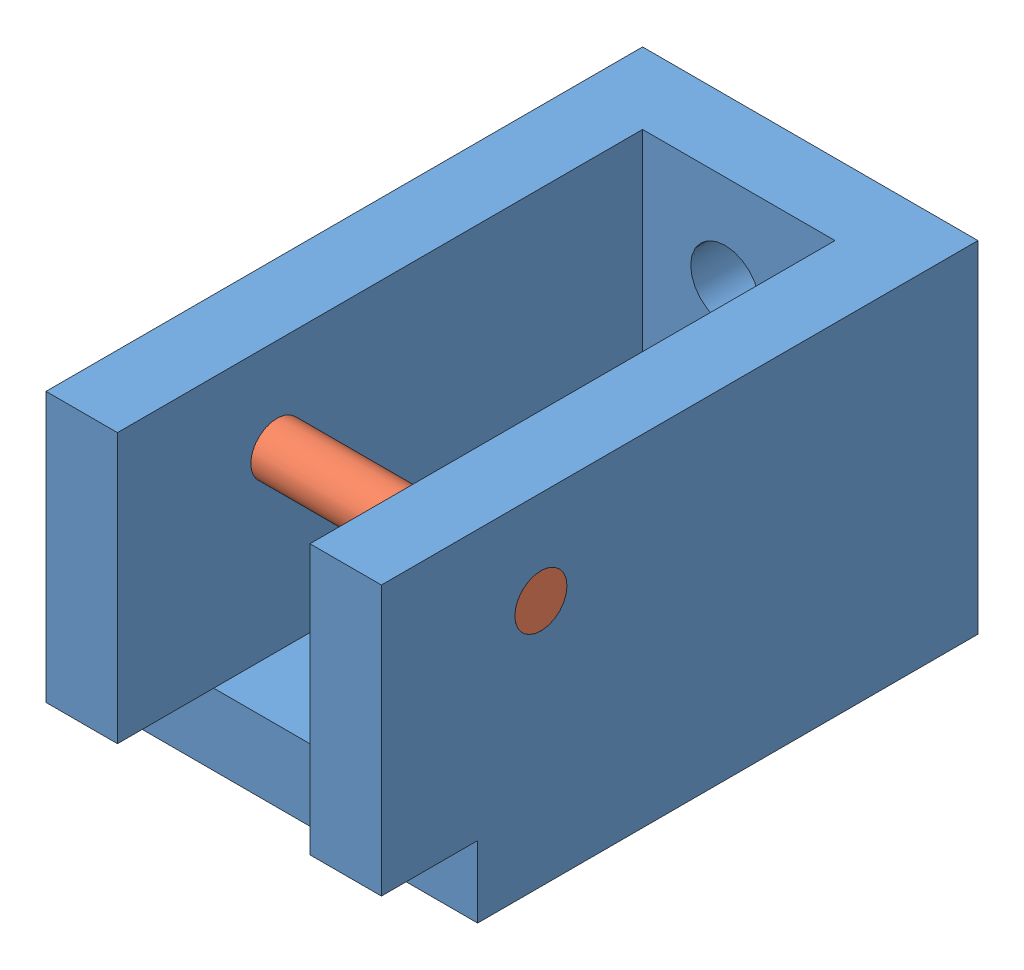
SolidWorks assembly Bati avec tige.SLDASM, configuration Défaut (file format 10000). Lengths in mm.
Overall size (122 124 217).
2 component instances, 2 part files, 2 mates.
Components (placement in the parent):
- Bâti 1-1: Bâti 1.SLDPRT [Défaut] at origin size (122 124 217)
- Arbre 6-1: Arbre 6.SLDPRT [Défaut] at (122 90 159) x (0 0 1) z (-1 0 0) size (19 19 122)
Mates (geometry in assembly coordinates):
- Coaxiale1: concentric anti-aligned: cylinder of Bâti 1-1 through (122 90 159) axis (-1 0 0) radius 9.5; cylinder of Arbre 6-1 through (0 90 159) axis (1 0 0) radius 9.5
- Coïncidente1: coincident aligned: plane of Bâti 1-1 through (122 0 26) normal (1 0 0); plane of Arbre 6-1 through (122 90 159) normal (1 0 0)
